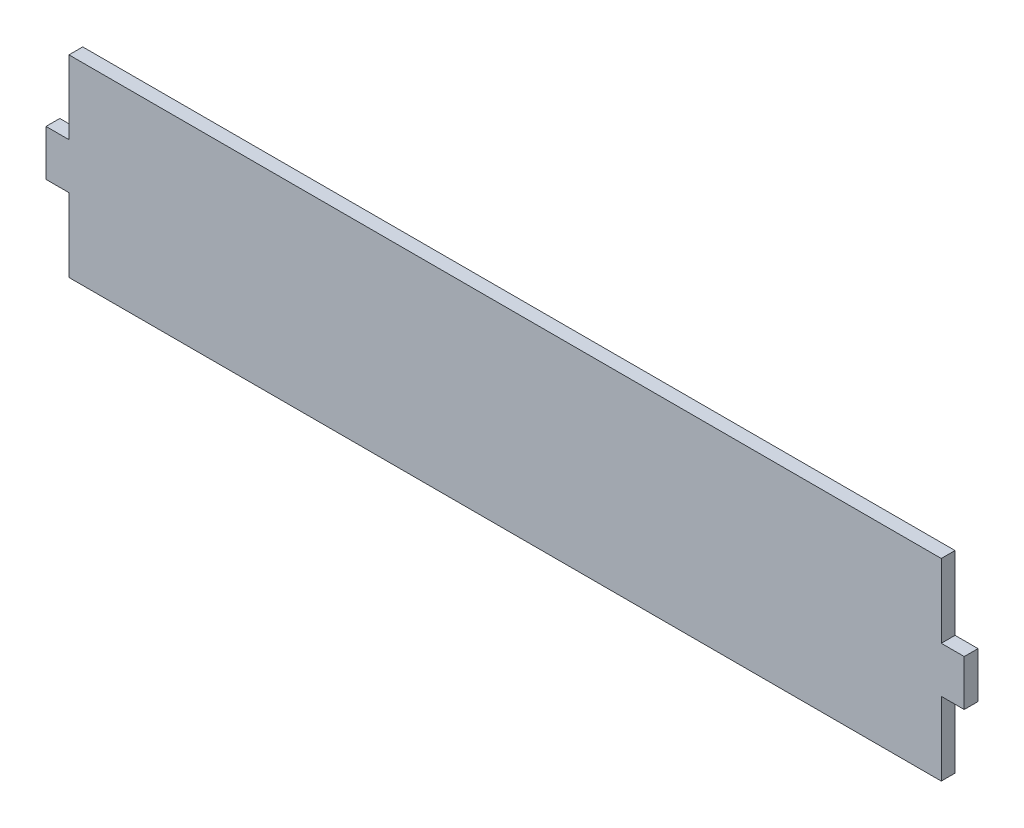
ISO-10303-21;
HEADER;
FILE_DESCRIPTION(('STEP AP214'),'2;1');
FILE_NAME('part.step','',(''),(''),'','','');
FILE_SCHEMA(('AUTOMOTIVE_DESIGN { 1 0 10303 214 1 1 1 1 }'));
ENDSEC;
DATA;
#1=APPLICATION_CONTEXT('core data for automotive mechanical design processes');
#2=APPLICATION_PROTOCOL_DEFINITION('international standard','automotive_design',2000,#1);
#3=PRODUCT_CONTEXT('',#1,'mechanical');
#4=PRODUCT('Part','Part','',(#3));
#5=PRODUCT_RELATED_PRODUCT_CATEGORY('part','',(#4));
#6=PRODUCT_DEFINITION_FORMATION('','',#4);
#7=PRODUCT_DEFINITION_CONTEXT('part definition',#1,'design');
#8=PRODUCT_DEFINITION('design','',#6,#7);
#9=PRODUCT_DEFINITION_SHAPE('','',#8);
#10=(LENGTH_UNIT() NAMED_UNIT(*) SI_UNIT(.MILLI.,.METRE.));
#11=(NAMED_UNIT(*) PLANE_ANGLE_UNIT() SI_UNIT($,.RADIAN.));
#12=(NAMED_UNIT(*) SI_UNIT($,.STERADIAN.) SOLID_ANGLE_UNIT());
#13=UNCERTAINTY_MEASURE_WITH_UNIT(LENGTH_MEASURE(1.E-05),#10,'distance_accuracy_value','');
#14=(GEOMETRIC_REPRESENTATION_CONTEXT(3) GLOBAL_UNCERTAINTY_ASSIGNED_CONTEXT((#13)) GLOBAL_UNIT_ASSIGNED_CONTEXT((#10,
#11,#12)) REPRESENTATION_CONTEXT('',''));
#15=CARTESIAN_POINT('',(0.,0.,0.));
#16=DIRECTION('',(0.,0.,1.));
#17=DIRECTION('',(1.,0.,0.));
#18=AXIS2_PLACEMENT_3D('',#15,#16,#17);
#19=CARTESIAN_POINT('',(-107.058637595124,33.02,3.81));
#20=DIRECTION('',(0.,-1.,0.));
#21=DIRECTION('',(0.,0.,-1.));
#22=AXIS2_PLACEMENT_3D('',#19,#20,#21);
#23=PLANE('',#22);
#24=DIRECTION('',(-1.,0.,0.));
#25=VECTOR('',#24,1.);
#26=CARTESIAN_POINT('',(-107.058637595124,33.02,0.));
#27=LINE('',#26,#25);
#28=CARTESIAN_POINT('',(134.241362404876,33.02,0.));
#29=VERTEX_POINT('',#28);
#30=CARTESIAN_POINT('',(-107.058637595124,33.02,0.));
#31=VERTEX_POINT('',#30);
#32=EDGE_CURVE('E123',#29,#31,#27,.T.);
#33=ORIENTED_EDGE('',*,*,#32,.T.);
#34=DIRECTION('',(0.,0.,-1.));
#35=VECTOR('',#34,1.);
#36=CARTESIAN_POINT('',(-107.058637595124,33.02,3.81));
#37=LINE('',#36,#35);
#38=CARTESIAN_POINT('',(-107.058637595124,33.02,3.81));
#39=VERTEX_POINT('',#38);
#40=EDGE_CURVE('E11',#39,#31,#37,.T.);
#41=ORIENTED_EDGE('',*,*,#40,.F.);
#42=DIRECTION('',(-1.,0.,0.));
#43=VECTOR('',#42,1.);
#44=CARTESIAN_POINT('',(-107.058637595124,33.02,3.81));
#45=LINE('',#44,#43);
#46=CARTESIAN_POINT('',(134.241362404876,33.02,3.81));
#47=VERTEX_POINT('',#46);
#48=EDGE_CURVE('E158',#47,#39,#45,.T.);
#49=ORIENTED_EDGE('',*,*,#48,.F.);
#50=DIRECTION('',(0.,0.,-1.));
#51=VECTOR('',#50,1.);
#52=CARTESIAN_POINT('',(134.241362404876,33.02,3.81));
#53=LINE('',#52,#51);
#54=EDGE_CURVE('E136',#47,#29,#53,.T.);
#55=ORIENTED_EDGE('',*,*,#54,.T.);
#56=EDGE_LOOP('',(#33,#41,#49,#55));
#57=FACE_BOUND('',#56,.T.);
#58=ADVANCED_FACE('F31',(#57),#23,.F.);
#59=CARTESIAN_POINT('',(-107.058637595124,12.7,3.81));
#60=DIRECTION('',(1.,0.,0.));
#61=DIRECTION('',(0.,0.,-1.));
#62=AXIS2_PLACEMENT_3D('',#59,#60,#61);
#63=PLANE('',#62);
#64=DIRECTION('',(0.,-1.,0.));
#65=VECTOR('',#64,1.);
#66=CARTESIAN_POINT('',(-107.058637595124,12.7,0.));
#67=LINE('',#66,#65);
#68=CARTESIAN_POINT('',(-107.058637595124,12.7,0.));
#69=VERTEX_POINT('',#68);
#70=EDGE_CURVE('E119',#31,#69,#67,.T.);
#71=ORIENTED_EDGE('',*,*,#70,.T.);
#72=DIRECTION('',(0.,0.,-1.));
#73=VECTOR('',#72,1.);
#74=CARTESIAN_POINT('',(-107.058637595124,12.7,3.81));
#75=LINE('',#74,#73);
#76=CARTESIAN_POINT('',(-107.058637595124,12.7,3.81));
#77=VERTEX_POINT('',#76);
#78=EDGE_CURVE('E38',#77,#69,#75,.T.);
#79=ORIENTED_EDGE('',*,*,#78,.F.);
#80=DIRECTION('',(0.,-1.,0.));
#81=VECTOR('',#80,1.);
#82=CARTESIAN_POINT('',(-107.058637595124,12.7,3.81));
#83=LINE('',#82,#81);
#84=EDGE_CURVE('E132',#39,#77,#83,.T.);
#85=ORIENTED_EDGE('',*,*,#84,.F.);
#86=ORIENTED_EDGE('',*,*,#40,.T.);
#87=EDGE_LOOP('',(#71,#79,#85,#86));
#88=FACE_BOUND('',#87,.T.);
#89=ADVANCED_FACE('F131',(#88),#63,.F.);
#90=CARTESIAN_POINT('',(-113.408637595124,12.7,3.81));
#91=DIRECTION('',(0.,-1.,0.));
#92=DIRECTION('',(0.,0.,-1.));
#93=AXIS2_PLACEMENT_3D('',#90,#91,#92);
#94=PLANE('',#93);
#95=DIRECTION('',(-1.,0.,0.));
#96=VECTOR('',#95,1.);
#97=CARTESIAN_POINT('',(-113.408637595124,12.7,0.));
#98=LINE('',#97,#96);
#99=CARTESIAN_POINT('',(-113.408637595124,12.7,0.));
#100=VERTEX_POINT('',#99);
#101=EDGE_CURVE('E125',#69,#100,#98,.T.);
#102=ORIENTED_EDGE('',*,*,#101,.T.);
#103=DIRECTION('',(0.,0.,-1.));
#104=VECTOR('',#103,1.);
#105=CARTESIAN_POINT('',(-113.408637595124,12.7,3.81));
#106=LINE('',#105,#104);
#107=CARTESIAN_POINT('',(-113.408637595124,12.7,3.81));
#108=VERTEX_POINT('',#107);
#109=EDGE_CURVE('E204',#108,#100,#106,.T.);
#110=ORIENTED_EDGE('',*,*,#109,.F.);
#111=DIRECTION('',(-1.,0.,0.));
#112=VECTOR('',#111,1.);
#113=CARTESIAN_POINT('',(-113.408637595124,12.7,3.81));
#114=LINE('',#113,#112);
#115=EDGE_CURVE('E161',#77,#108,#114,.T.);
#116=ORIENTED_EDGE('',*,*,#115,.F.);
#117=ORIENTED_EDGE('',*,*,#78,.T.);
#118=EDGE_LOOP('',(#102,#110,#116,#117));
#119=FACE_BOUND('',#118,.T.);
#120=ADVANCED_FACE('F208',(#119),#94,.F.);
#121=CARTESIAN_POINT('',(-113.408637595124,12.7,3.81));
#122=DIRECTION('',(1.,0.,0.));
#123=DIRECTION('',(0.,0.,-1.));
#124=AXIS2_PLACEMENT_3D('',#121,#122,#123);
#125=PLANE('',#124);
#126=DIRECTION('',(0.,-1.,0.));
#127=VECTOR('',#126,1.);
#128=CARTESIAN_POINT('',(-113.408637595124,12.7,0.));
#129=LINE('',#128,#127);
#130=CARTESIAN_POINT('',(-113.408637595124,0.,0.));
#131=VERTEX_POINT('',#130);
#132=EDGE_CURVE('E140',#100,#131,#129,.T.);
#133=ORIENTED_EDGE('',*,*,#132,.T.);
#134=DIRECTION('',(0.,0.,-1.));
#135=VECTOR('',#134,1.);
#136=CARTESIAN_POINT('',(-113.408637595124,0.,3.81));
#137=LINE('',#136,#135);
#138=CARTESIAN_POINT('',(-113.408637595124,0.,3.81));
#139=VERTEX_POINT('',#138);
#140=EDGE_CURVE('E201',#139,#131,#137,.T.);
#141=ORIENTED_EDGE('',*,*,#140,.F.);
#142=DIRECTION('',(0.,-1.,0.));
#143=VECTOR('',#142,1.);
#144=CARTESIAN_POINT('',(-113.408637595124,12.7,3.81));
#145=LINE('',#144,#143);
#146=EDGE_CURVE('E163',#108,#139,#145,.T.);
#147=ORIENTED_EDGE('',*,*,#146,.F.);
#148=ORIENTED_EDGE('',*,*,#109,.T.);
#149=EDGE_LOOP('',(#133,#141,#147,#148));
#150=FACE_BOUND('',#149,.T.);
#151=ADVANCED_FACE('F216',(#150),#125,.F.);
#152=CARTESIAN_POINT('',(-113.408637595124,0.,3.81));
#153=DIRECTION('',(0.,1.,0.));
#154=DIRECTION('',(0.,0.,1.));
#155=AXIS2_PLACEMENT_3D('',#152,#153,#154);
#156=PLANE('',#155);
#157=DIRECTION('',(1.,0.,0.));
#158=VECTOR('',#157,1.);
#159=CARTESIAN_POINT('',(-113.408637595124,0.,0.));
#160=LINE('',#159,#158);
#161=CARTESIAN_POINT('',(-107.058637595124,0.,0.));
#162=VERTEX_POINT('',#161);
#163=EDGE_CURVE('E142',#131,#162,#160,.T.);
#164=ORIENTED_EDGE('',*,*,#163,.T.);
#165=DIRECTION('',(0.,0.,-1.));
#166=VECTOR('',#165,1.);
#167=CARTESIAN_POINT('',(-107.058637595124,0.,3.81));
#168=LINE('',#167,#166);
#169=CARTESIAN_POINT('',(-107.058637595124,0.,3.81));
#170=VERTEX_POINT('',#169);
#171=EDGE_CURVE('E198',#170,#162,#168,.T.);
#172=ORIENTED_EDGE('',*,*,#171,.F.);
#173=DIRECTION('',(1.,0.,0.));
#174=VECTOR('',#173,1.);
#175=CARTESIAN_POINT('',(-113.408637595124,0.,3.81));
#176=LINE('',#175,#174);
#177=EDGE_CURVE('E165',#139,#170,#176,.T.);
#178=ORIENTED_EDGE('',*,*,#177,.F.);
#179=ORIENTED_EDGE('',*,*,#140,.T.);
#180=EDGE_LOOP('',(#164,#172,#178,#179));
#181=FACE_BOUND('',#180,.T.);
#182=ADVANCED_FACE('F219',(#181),#156,.F.);
#183=CARTESIAN_POINT('',(-107.058637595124,0.,3.81));
#184=DIRECTION('',(1.,0.,0.));
#185=DIRECTION('',(0.,1.,0.));
#186=AXIS2_PLACEMENT_3D('',#183,#184,#185);
#187=PLANE('',#186);
#188=DIRECTION('',(0.,-1.,0.));
#189=VECTOR('',#188,1.);
#190=CARTESIAN_POINT('',(-107.058637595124,0.,0.));
#191=LINE('',#190,#189);
#192=CARTESIAN_POINT('',(-107.058637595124,-20.32,0.));
#193=VERTEX_POINT('',#192);
#194=EDGE_CURVE('E144',#162,#193,#191,.T.);
#195=ORIENTED_EDGE('',*,*,#194,.T.);
#196=DIRECTION('',(0.,0.,-1.));
#197=VECTOR('',#196,1.);
#198=CARTESIAN_POINT('',(-107.058637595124,-20.32,3.81));
#199=LINE('',#198,#197);
#200=CARTESIAN_POINT('',(-107.058637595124,-20.32,3.81));
#201=VERTEX_POINT('',#200);
#202=EDGE_CURVE('E195',#201,#193,#199,.T.);
#203=ORIENTED_EDGE('',*,*,#202,.F.);
#204=DIRECTION('',(0.,-1.,0.));
#205=VECTOR('',#204,1.);
#206=CARTESIAN_POINT('',(-107.058637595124,0.,3.81));
#207=LINE('',#206,#205);
#208=EDGE_CURVE('E167',#170,#201,#207,.T.);
#209=ORIENTED_EDGE('',*,*,#208,.F.);
#210=ORIENTED_EDGE('',*,*,#171,.T.);
#211=EDGE_LOOP('',(#195,#203,#209,#210));
#212=FACE_BOUND('',#211,.T.);
#213=ADVANCED_FACE('F224',(#212),#187,.F.);
#214=CARTESIAN_POINT('',(-107.058637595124,-20.32,3.81));
#215=DIRECTION('',(0.,1.,0.));
#216=DIRECTION('',(0.,0.,1.));
#217=AXIS2_PLACEMENT_3D('',#214,#215,#216);
#218=PLANE('',#217);
#219=DIRECTION('',(1.,0.,0.));
#220=VECTOR('',#219,1.);
#221=CARTESIAN_POINT('',(-107.058637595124,-20.32,0.));
#222=LINE('',#221,#220);
#223=CARTESIAN_POINT('',(134.241362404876,-20.32,0.));
#224=VERTEX_POINT('',#223);
#225=EDGE_CURVE('E146',#193,#224,#222,.T.);
#226=ORIENTED_EDGE('',*,*,#225,.T.);
#227=DIRECTION('',(0.,0.,-1.));
#228=VECTOR('',#227,1.);
#229=CARTESIAN_POINT('',(134.241362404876,-20.32,3.81));
#230=LINE('',#229,#228);
#231=CARTESIAN_POINT('',(134.241362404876,-20.32,3.81));
#232=VERTEX_POINT('',#231);
#233=EDGE_CURVE('E192',#232,#224,#230,.T.);
#234=ORIENTED_EDGE('',*,*,#233,.F.);
#235=DIRECTION('',(1.,0.,0.));
#236=VECTOR('',#235,1.);
#237=CARTESIAN_POINT('',(-107.058637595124,-20.32,3.81));
#238=LINE('',#237,#236);
#239=EDGE_CURVE('E169',#201,#232,#238,.T.);
#240=ORIENTED_EDGE('',*,*,#239,.F.);
#241=ORIENTED_EDGE('',*,*,#202,.T.);
#242=EDGE_LOOP('',(#226,#234,#240,#241));
#243=FACE_BOUND('',#242,.T.);
#244=ADVANCED_FACE('F230',(#243),#218,.F.);
#245=CARTESIAN_POINT('',(134.241362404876,0.,3.81));
#246=DIRECTION('',(-1.,0.,0.));
#247=DIRECTION('',(0.,0.,1.));
#248=AXIS2_PLACEMENT_3D('',#245,#246,#247);
#249=PLANE('',#248);
#250=DIRECTION('',(0.,1.,0.));
#251=VECTOR('',#250,1.);
#252=CARTESIAN_POINT('',(134.241362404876,0.,0.));
#253=LINE('',#252,#251);
#254=CARTESIAN_POINT('',(134.241362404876,0.,0.));
#255=VERTEX_POINT('',#254);
#256=EDGE_CURVE('E148',#224,#255,#253,.T.);
#257=ORIENTED_EDGE('',*,*,#256,.T.);
#258=DIRECTION('',(0.,0.,-1.));
#259=VECTOR('',#258,1.);
#260=CARTESIAN_POINT('',(134.241362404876,0.,3.81));
#261=LINE('',#260,#259);
#262=CARTESIAN_POINT('',(134.241362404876,0.,3.81));
#263=VERTEX_POINT('',#262);
#264=EDGE_CURVE('E189',#263,#255,#261,.T.);
#265=ORIENTED_EDGE('',*,*,#264,.F.);
#266=DIRECTION('',(0.,1.,0.));
#267=VECTOR('',#266,1.);
#268=CARTESIAN_POINT('',(134.241362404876,0.,3.81));
#269=LINE('',#268,#267);
#270=EDGE_CURVE('E171',#232,#263,#269,.T.);
#271=ORIENTED_EDGE('',*,*,#270,.F.);
#272=ORIENTED_EDGE('',*,*,#233,.T.);
#273=EDGE_LOOP('',(#257,#265,#271,#272));
#274=FACE_BOUND('',#273,.T.);
#275=ADVANCED_FACE('F234',(#274),#249,.F.);
#276=CARTESIAN_POINT('',(134.241362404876,0.,3.81));
#277=DIRECTION('',(0.,1.,0.));
#278=DIRECTION('',(0.,0.,1.));
#279=AXIS2_PLACEMENT_3D('',#276,#277,#278);
#280=PLANE('',#279);
#281=DIRECTION('',(1.,0.,0.));
#282=VECTOR('',#281,1.);
#283=CARTESIAN_POINT('',(134.241362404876,0.,0.));
#284=LINE('',#283,#282);
#285=CARTESIAN_POINT('',(140.591362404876,0.,0.));
#286=VERTEX_POINT('',#285);
#287=EDGE_CURVE('E150',#255,#286,#284,.T.);
#288=ORIENTED_EDGE('',*,*,#287,.T.);
#289=DIRECTION('',(0.,0.,-1.));
#290=VECTOR('',#289,1.);
#291=CARTESIAN_POINT('',(140.591362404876,0.,3.81));
#292=LINE('',#291,#290);
#293=CARTESIAN_POINT('',(140.591362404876,0.,3.81));
#294=VERTEX_POINT('',#293);
#295=EDGE_CURVE('E186',#294,#286,#292,.T.);
#296=ORIENTED_EDGE('',*,*,#295,.F.);
#297=DIRECTION('',(1.,0.,0.));
#298=VECTOR('',#297,1.);
#299=CARTESIAN_POINT('',(134.241362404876,0.,3.81));
#300=LINE('',#299,#298);
#301=EDGE_CURVE('E173',#263,#294,#300,.T.);
#302=ORIENTED_EDGE('',*,*,#301,.F.);
#303=ORIENTED_EDGE('',*,*,#264,.T.);
#304=EDGE_LOOP('',(#288,#296,#302,#303));
#305=FACE_BOUND('',#304,.T.);
#306=ADVANCED_FACE('F239',(#305),#280,.F.);
#307=CARTESIAN_POINT('',(140.591362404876,12.7,3.81));
#308=DIRECTION('',(-1.,0.,0.));
#309=DIRECTION('',(0.,0.,1.));
#310=AXIS2_PLACEMENT_3D('',#307,#308,#309);
#311=PLANE('',#310);
#312=DIRECTION('',(0.,1.,0.));
#313=VECTOR('',#312,1.);
#314=CARTESIAN_POINT('',(140.591362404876,12.7,0.));
#315=LINE('',#314,#313);
#316=CARTESIAN_POINT('',(140.591362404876,12.7,0.));
#317=VERTEX_POINT('',#316);
#318=EDGE_CURVE('E152',#286,#317,#315,.T.);
#319=ORIENTED_EDGE('',*,*,#318,.T.);
#320=DIRECTION('',(0.,0.,-1.));
#321=VECTOR('',#320,1.);
#322=CARTESIAN_POINT('',(140.591362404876,12.7,3.81));
#323=LINE('',#322,#321);
#324=CARTESIAN_POINT('',(140.591362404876,12.7,3.81));
#325=VERTEX_POINT('',#324);
#326=EDGE_CURVE('E183',#325,#317,#323,.T.);
#327=ORIENTED_EDGE('',*,*,#326,.F.);
#328=DIRECTION('',(0.,1.,0.));
#329=VECTOR('',#328,1.);
#330=CARTESIAN_POINT('',(140.591362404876,12.7,3.81));
#331=LINE('',#330,#329);
#332=EDGE_CURVE('E175',#294,#325,#331,.T.);
#333=ORIENTED_EDGE('',*,*,#332,.F.);
#334=ORIENTED_EDGE('',*,*,#295,.T.);
#335=EDGE_LOOP('',(#319,#327,#333,#334));
#336=FACE_BOUND('',#335,.T.);
#337=ADVANCED_FACE('F243',(#336),#311,.F.);
#338=CARTESIAN_POINT('',(134.241362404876,12.7,3.81));
#339=DIRECTION('',(0.,-1.,0.));
#340=DIRECTION('',(0.,0.,-1.));
#341=AXIS2_PLACEMENT_3D('',#338,#339,#340);
#342=PLANE('',#341);
#343=DIRECTION('',(-1.,0.,0.));
#344=VECTOR('',#343,1.);
#345=CARTESIAN_POINT('',(134.241362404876,12.7,0.));
#346=LINE('',#345,#344);
#347=CARTESIAN_POINT('',(134.241362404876,12.7,0.));
#348=VERTEX_POINT('',#347);
#349=EDGE_CURVE('E154',#317,#348,#346,.T.);
#350=ORIENTED_EDGE('',*,*,#349,.T.);
#351=DIRECTION('',(0.,0.,-1.));
#352=VECTOR('',#351,1.);
#353=CARTESIAN_POINT('',(134.241362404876,12.7,3.81));
#354=LINE('',#353,#352);
#355=CARTESIAN_POINT('',(134.241362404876,12.7,3.81));
#356=VERTEX_POINT('',#355);
#357=EDGE_CURVE('E180',#356,#348,#354,.T.);
#358=ORIENTED_EDGE('',*,*,#357,.F.);
#359=DIRECTION('',(-1.,0.,0.));
#360=VECTOR('',#359,1.);
#361=CARTESIAN_POINT('',(134.241362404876,12.7,3.81));
#362=LINE('',#361,#360);
#363=EDGE_CURVE('E50',#325,#356,#362,.T.);
#364=ORIENTED_EDGE('',*,*,#363,.F.);
#365=ORIENTED_EDGE('',*,*,#326,.T.);
#366=EDGE_LOOP('',(#350,#358,#364,#365));
#367=FACE_BOUND('',#366,.T.);
#368=ADVANCED_FACE('F247',(#367),#342,.F.);
#369=CARTESIAN_POINT('',(134.241362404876,12.7,3.81));
#370=DIRECTION('',(-1.,0.,0.));
#371=DIRECTION('',(0.,0.,1.));
#372=AXIS2_PLACEMENT_3D('',#369,#370,#371);
#373=PLANE('',#372);
#374=DIRECTION('',(0.,1.,0.));
#375=VECTOR('',#374,1.);
#376=CARTESIAN_POINT('',(134.241362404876,12.7,0.));
#377=LINE('',#376,#375);
#378=EDGE_CURVE('E156',#348,#29,#377,.T.);
#379=ORIENTED_EDGE('',*,*,#378,.T.);
#380=ORIENTED_EDGE('',*,*,#54,.F.);
#381=DIRECTION('',(0.,1.,0.));
#382=VECTOR('',#381,1.);
#383=CARTESIAN_POINT('',(134.241362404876,12.7,3.81));
#384=LINE('',#383,#382);
#385=EDGE_CURVE('E45',#356,#47,#384,.T.);
#386=ORIENTED_EDGE('',*,*,#385,.F.);
#387=ORIENTED_EDGE('',*,*,#357,.T.);
#388=EDGE_LOOP('',(#379,#380,#386,#387));
#389=FACE_BOUND('',#388,.T.);
#390=ADVANCED_FACE('F249',(#389),#373,.F.);
#391=CARTESIAN_POINT('',(134.241362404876,33.02,3.81));
#392=DIRECTION('',(0.,0.,1.));
#393=DIRECTION('',(1.,0.,0.));
#394=AXIS2_PLACEMENT_3D('',#391,#392,#393);
#395=PLANE('',#394);
#396=ORIENTED_EDGE('',*,*,#48,.T.);
#397=ORIENTED_EDGE('',*,*,#84,.T.);
#398=ORIENTED_EDGE('',*,*,#115,.T.);
#399=ORIENTED_EDGE('',*,*,#146,.T.);
#400=ORIENTED_EDGE('',*,*,#177,.T.);
#401=ORIENTED_EDGE('',*,*,#208,.T.);
#402=ORIENTED_EDGE('',*,*,#239,.T.);
#403=ORIENTED_EDGE('',*,*,#270,.T.);
#404=ORIENTED_EDGE('',*,*,#301,.T.);
#405=ORIENTED_EDGE('',*,*,#332,.T.);
#406=ORIENTED_EDGE('',*,*,#363,.T.);
#407=ORIENTED_EDGE('',*,*,#385,.T.);
#408=EDGE_LOOP('',(#396,#397,#398,#399,#400,#401,#402,#403,#404,#405,#406,#407));
#409=FACE_BOUND('',#408,.T.);
#410=ADVANCED_FACE('F211',(#409),#395,.T.);
#411=CARTESIAN_POINT('',(134.241362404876,33.02,0.));
#412=DIRECTION('',(0.,0.,1.));
#413=DIRECTION('',(1.,0.,0.));
#414=AXIS2_PLACEMENT_3D('',#411,#412,#413);
#415=PLANE('',#414);
#416=ORIENTED_EDGE('',*,*,#32,.F.);
#417=ORIENTED_EDGE('',*,*,#378,.F.);
#418=ORIENTED_EDGE('',*,*,#349,.F.);
#419=ORIENTED_EDGE('',*,*,#318,.F.);
#420=ORIENTED_EDGE('',*,*,#287,.F.);
#421=ORIENTED_EDGE('',*,*,#256,.F.);
#422=ORIENTED_EDGE('',*,*,#225,.F.);
#423=ORIENTED_EDGE('',*,*,#194,.F.);
#424=ORIENTED_EDGE('',*,*,#163,.F.);
#425=ORIENTED_EDGE('',*,*,#132,.F.);
#426=ORIENTED_EDGE('',*,*,#101,.F.);
#427=ORIENTED_EDGE('',*,*,#70,.F.);
#428=EDGE_LOOP('',(#416,#417,#418,#419,#420,#421,#422,#423,#424,#425,#426,#427));
#429=FACE_BOUND('',#428,.T.);
#430=ADVANCED_FACE('F120',(#429),#415,.F.);
#431=CLOSED_SHELL('',(#58,#89,#120,#151,#182,#213,#244,#275,#306,#337,#368,#390,#410,#430));
#432=MANIFOLD_SOLID_BREP('B2',#431);
#433=ADVANCED_BREP_SHAPE_REPRESENTATION('',(#18,#432),#14);
#434=SHAPE_DEFINITION_REPRESENTATION(#9,#433);
ENDSEC;
END-ISO-10303-21;
